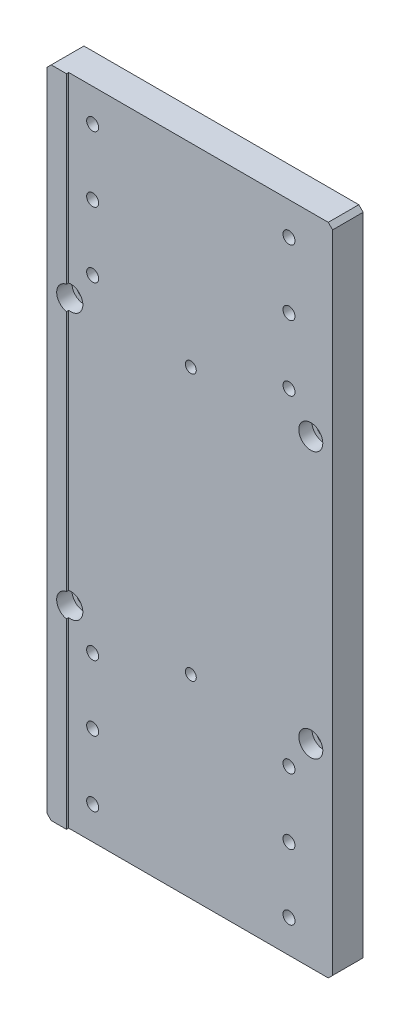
from build123d import *

# Parameters (mm, degrees)
SKETCH_1_W                   = 130
SKETCH_1_H                   = 300
EXTRUDE_2_DEPTH              = 7.5
SKETCH_3_W                   = 121
SKETCH_3_H                   = 300
CUT_EXTRUDE_1_DEPTH          = 1
HOLE_WIZARD_M6_1_D           = 6.6
HOLE_WIZARD_M6_1_CBORE_D     = 11
HOLE_WIZARD_M6_1_CBORE_DEPTH = 7
HOLE_WIZARD_M5_1_D           = 5.5
HOLE_WIZARD_M5_1_CBORE_D     = 9.5
HOLE_WIZARD_M5_1_CBORE_DEPTH = 7
PATTERN_LINEAR_1_COUNT       = 2
PATTERN_LINEAR_1_PITCH       = 210
F_5_0MM_1_D                  = 5
CHAMFER_1_SIZE               = 2


with BuildPart() as part:
    # Sketch 1 → Extrude 2 (new, symmetric)
    with BuildSketch(Plane.XY):
        Rectangle(SKETCH_1_W, SKETCH_1_H)
    extrude(amount=EXTRUDE_2_DEPTH, both=True)

    # Sketch 3 → Cut-Extrude 1 (cut)
    with BuildSketch(Plane.XY.offset(7.5)):
        with Locations((4.5, 0)):
            Rectangle(SKETCH_3_W, SKETCH_3_H)
    extrude(amount=-CUT_EXTRUDE_1_DEPTH, mode=Mode.SUBTRACT)

    # Hole Wizard M6 _ _ _ _ _1 (through all)
    with Locations(Plane.XY.offset(7.5)):
        with Locations((-55, 61), (55, 61), (-55, -61), (55, -61)):
            CounterBoreHole(HOLE_WIZARD_M6_1_D / 2, HOLE_WIZARD_M6_1_CBORE_D / 2, HOLE_WIZARD_M6_1_CBORE_DEPTH)

    # Hole Wizard M5 _ _ _ _ _1 (through all)
    with Locations(Plane(origin=(0, 0, -7.5), x_dir=(-1, 0, 0), z_dir=(0, 0, -1))):
        with Locations((-45, 135), (-45, 105), (45, 105), (45, 135), (-45, 75), (45, 75)):
            hole_wizard_m5_1 = CounterBoreHole(HOLE_WIZARD_M5_1_D / 2, HOLE_WIZARD_M5_1_CBORE_D / 2, HOLE_WIZARD_M5_1_CBORE_DEPTH)

    # Pattern Linear 1: Hole Wizard M5 _ _ _ _ _1 ×2
    with Locations(*[(0, -i * PATTERN_LINEAR_1_PITCH, 0) for i in range(1, PATTERN_LINEAR_1_COUNT)]):
        add(hole_wizard_m5_1, mode=Mode.SUBTRACT)

    # 5.0mm _ _1 (through all)
    with Locations(Plane.XY.offset(6.5)):
        with Locations((0, -61), (0, 61)):
            Hole(F_5_0MM_1_D / 2)

    # Chamfer 1
    chamfer_1_edges = [part.edges().sort_by_distance(p)[0] for p in [
        (65, -150, -0.5),
        (65, 150, -0.5),
        (-65, -150, 0),
        (-65, 150, 0),
    ]]
    chamfer(chamfer_1_edges, length=CHAMFER_1_SIZE)


solid = part.part
